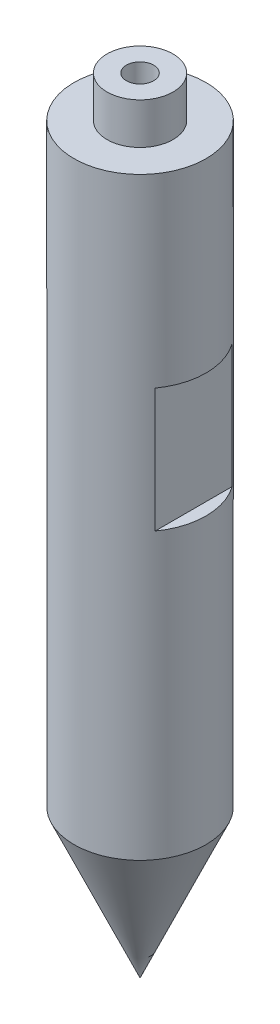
from build123d import *

# Parameters (mm, degrees)
SKETCH_10_R              = 4
EXTRUDE_1_DEPTH          = 5
CUT_EXTRUDE_1_DEPTH      = 91.708323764
CUT_EXTRUDE_1_DEPTH_BACK = 91.708323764
SKETCH_19_W              = 40
SKETCH_19_H              = 15
HOLE_WIZARD_M4_1_D       = 3.3
HOLE_WIZARD_M4_1_DEPTH   = 10.1
HOLE_WIZARD_M4_1_TIP     = 0.991420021


with BuildPart() as part:
    # Sketch 1 → Revolve 1 (revolve)
    with BuildSketch(Plane.XY, mode=Mode.PRIVATE) as revolve_1_sk:
        Polygon((0, 0), (-8, 0), (-8, -72), (0, -90), align=None)
    revolve(revolve_1_sk.sketch.rotate(Axis((0, -90, 0), (0, 1, 0)), 270), axis=Axis((0, -90, 0), (0, 1, 0)))

    # Sketch 10 → Extrude 1 (add)
    with BuildSketch(Plane(origin=(0, 0, 0), x_dir=(1, 0, 0), z_dir=(0, 1, 0))):
        with Locations(Location((0, 0, 0), (0, 0, 270))):
            Circle(SKETCH_10_R)
    extrude(amount=EXTRUDE_1_DEPTH)

    # Sketch 19 → Cut-Extrude 1 (cut, two sides: drawn at the far end of the back side and taken through both)
    with BuildSketch(Plane.XY.offset(-CUT_EXTRUDE_1_DEPTH_BACK)):
        with Locations((26.5, -30)):
            Rectangle(SKETCH_19_W, SKETCH_19_H)
        with Locations((-26.5, -30)):
            Rectangle(SKETCH_19_W, SKETCH_19_H)
    extrude(amount=CUT_EXTRUDE_1_DEPTH + CUT_EXTRUDE_1_DEPTH_BACK, mode=Mode.SUBTRACT)

    # Hole Wizard M4 _1
    with Locations(Plane(origin=(0, 5, 0), x_dir=(1, 0, 0), z_dir=(0, 1, 0))):
        with Locations((0, 0)):
            Hole(HOLE_WIZARD_M4_1_D / 2, depth=HOLE_WIZARD_M4_1_DEPTH)
            with Locations((0, 0, -(HOLE_WIZARD_M4_1_DEPTH + HOLE_WIZARD_M4_1_TIP / 2))):  # 118° drill point
                Cone(0, HOLE_WIZARD_M4_1_D / 2, HOLE_WIZARD_M4_1_TIP, mode=Mode.SUBTRACT)


solid = part.part
